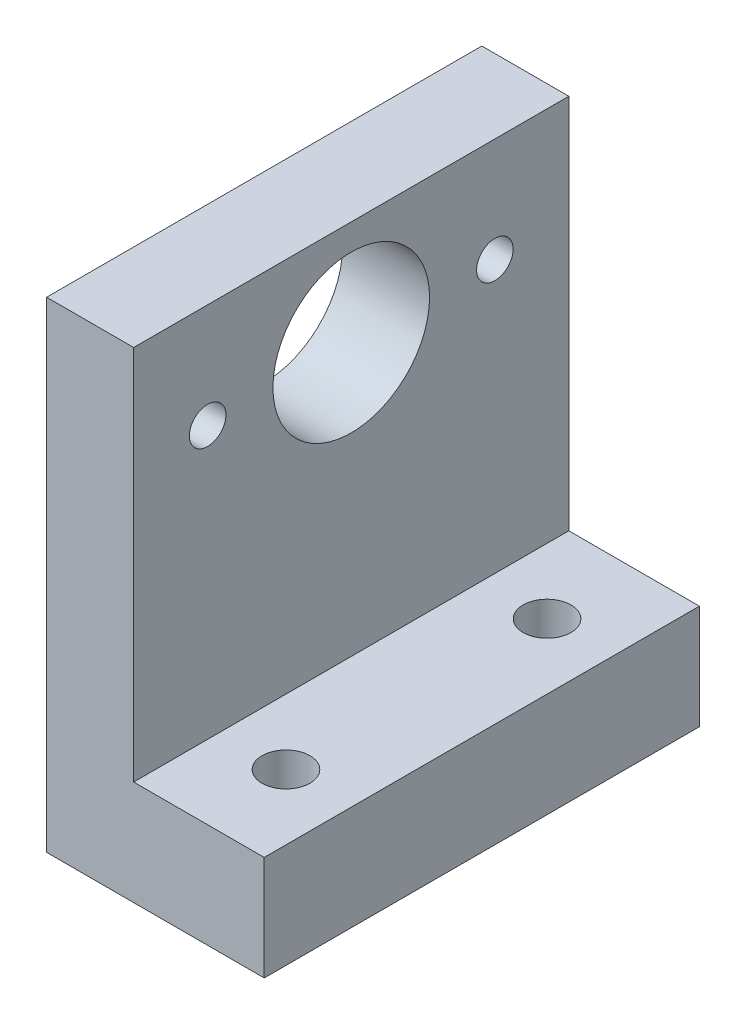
from build123d import *

# Parameters (mm, degrees)
EXTRUDE_1_DEPTH      = 50
SKETCH_2_OUTSIDE_W   = 67.718
SKETCH_2_OUTSIDE_H   = 72.958
SKETCH_2_OUTSIDE_W_2 = 50
SKETCH_2_OUTSIDE_H_2 = 55.24
SKETCH_2_OUTSIDE_R   = 2.1
SKETCH_2_OUTSIDE_R_2 = 9
CUT_EXTRUDE_1_DEPTH  = 50
SKETCH_3_R           = 2.75
CUT_EXTRUDE_2_DEPTH  = 50


with BuildPart() as part:
    # Sketch 1 → Extrude 1 (new body)
    with BuildSketch(Plane.XY):
        Polygon((0, 0), (0, 55.24), (10, 55.24), (10, 12), (25, 12), (25, 0), align=None)
    extrude(amount=EXTRUDE_1_DEPTH)

    # Sketch 2 outside → Cut-Extrude 1 (cut)
    # profile 1 of 4: a face of its own
    with BuildSketch(Plane(origin=(10, 0, 0), x_dir=(0, 0, -1), z_dir=(1, 0, 0))):
        with Locations((-25, 27.62)):
            Rectangle(SKETCH_2_OUTSIDE_W, SKETCH_2_OUTSIDE_H)
        with Locations((-25, 27.62)):
            Rectangle(SKETCH_2_OUTSIDE_W_2, SKETCH_2_OUTSIDE_H_2, mode=Mode.SUBTRACT)
    # profile 2 of 4: a face of its own
    with BuildSketch(Plane(origin=(10, 0, 0), x_dir=(0, 0, -1), z_dir=(1, 0, 0))):
        with Locations((-41.5, 43.24)):
            Circle(SKETCH_2_OUTSIDE_R)
    # profile 3 of 4: a face of its own
    with BuildSketch(Plane(origin=(10, 0, 0), x_dir=(0, 0, -1), z_dir=(1, 0, 0))):
        with Locations((-8.5, 43.24)):
            Circle(SKETCH_2_OUTSIDE_R)
    # profile 4 of 4: a face of its own
    with BuildSketch(Plane(origin=(10, 0, 0), x_dir=(0, 0, -1), z_dir=(1, 0, 0))):
        with Locations((-25, 43.24)):
            Circle(SKETCH_2_OUTSIDE_R_2)
    extrude(amount=-CUT_EXTRUDE_1_DEPTH, mode=Mode.SUBTRACT)

    # Sketch 3 → Cut-Extrude 2 (cut)
    with BuildSketch(Plane(origin=(0, 12, 0), x_dir=(1, 0, 0), z_dir=(0, 1, 0))):
        with Locations(Location((17.5, -10, 0), (0, 0, 270))):
            Circle(SKETCH_3_R)
        with Locations(Location((17.5, -40, 0), (0, 0, 270))):
            Circle(SKETCH_3_R)
    extrude(amount=-CUT_EXTRUDE_2_DEPTH, mode=Mode.SUBTRACT)


solid = part.part
